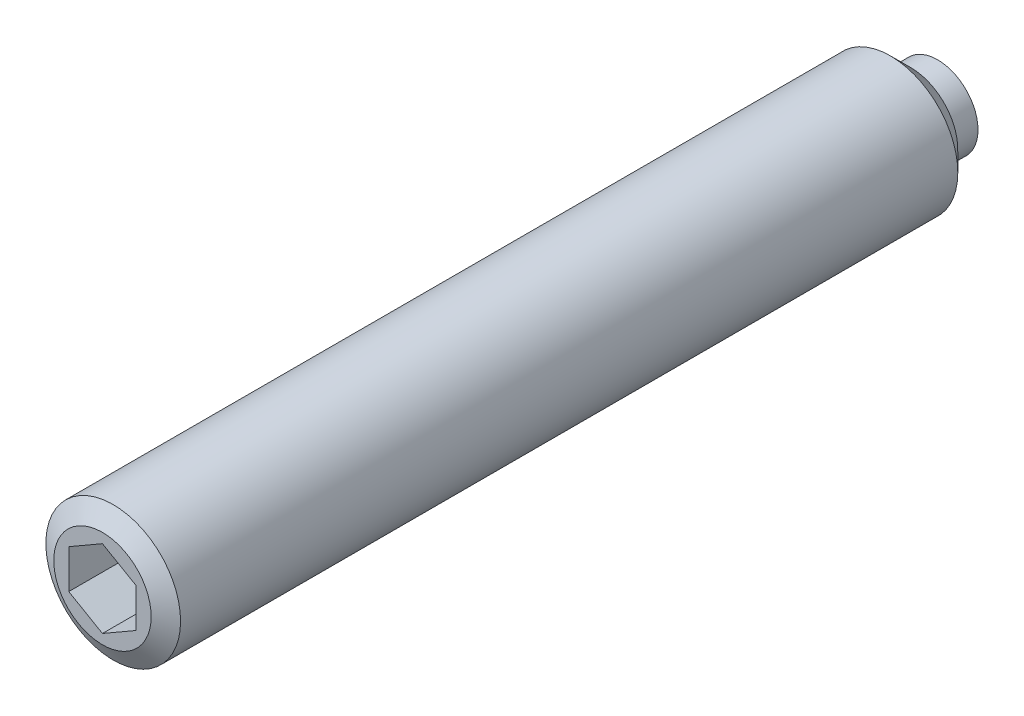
ISO-10303-21;
HEADER;
FILE_DESCRIPTION(('STEP AP214'),'2;1');
FILE_NAME('part.step','',(''),(''),'','','');
FILE_SCHEMA(('AUTOMOTIVE_DESIGN { 1 0 10303 214 1 1 1 1 }'));
ENDSEC;
DATA;
#1=APPLICATION_CONTEXT('core data for automotive mechanical design processes');
#2=APPLICATION_PROTOCOL_DEFINITION('international standard','automotive_design',2000,#1);
#3=PRODUCT_CONTEXT('',#1,'mechanical');
#4=PRODUCT('Part','Part','',(#3));
#5=PRODUCT_RELATED_PRODUCT_CATEGORY('part','',(#4));
#6=PRODUCT_DEFINITION_FORMATION('','',#4);
#7=PRODUCT_DEFINITION_CONTEXT('part definition',#1,'design');
#8=PRODUCT_DEFINITION('design','',#6,#7);
#9=PRODUCT_DEFINITION_SHAPE('','',#8);
#10=(LENGTH_UNIT() NAMED_UNIT(*) SI_UNIT(.MILLI.,.METRE.));
#11=(NAMED_UNIT(*) PLANE_ANGLE_UNIT() SI_UNIT($,.RADIAN.));
#12=(NAMED_UNIT(*) SI_UNIT($,.STERADIAN.) SOLID_ANGLE_UNIT());
#13=UNCERTAINTY_MEASURE_WITH_UNIT(LENGTH_MEASURE(1.E-05),#10,'distance_accuracy_value','');
#14=(GEOMETRIC_REPRESENTATION_CONTEXT(3) GLOBAL_UNCERTAINTY_ASSIGNED_CONTEXT((#13)) GLOBAL_UNIT_ASSIGNED_CONTEXT((#10,
#11,#12)) REPRESENTATION_CONTEXT('',''));
#15=CARTESIAN_POINT('',(0.,0.,0.));
#16=DIRECTION('',(0.,0.,1.));
#17=DIRECTION('',(1.,0.,0.));
#18=AXIS2_PLACEMENT_3D('',#15,#16,#17);
#19=CARTESIAN_POINT('',(3.,0.,0.));
#20=DIRECTION('',(0.,0.,-1.));
#21=DIRECTION('',(-1.,0.,0.));
#22=AXIS2_PLACEMENT_3D('',#19,#20,#21);
#23=PLANE('',#22);
#24=CARTESIAN_POINT('',(0.,0.,0.));
#25=DIRECTION('',(0.,0.,1.));
#26=DIRECTION('',(1.,0.,0.));
#27=AXIS2_PLACEMENT_3D('',#24,#25,#26);
#28=CIRCLE('',#27,3.);
#29=CARTESIAN_POINT('',(3.,0.,0.));
#30=VERTEX_POINT('',#29);
#31=EDGE_CURVE('E124',#30,#30,#28,.T.);
#32=ORIENTED_EDGE('',*,*,#31,.F.);
#33=EDGE_LOOP('',(#32));
#34=FACE_BOUND('',#33,.T.);
#35=ADVANCED_FACE('F14',(#34),#23,.T.);
#36=CARTESIAN_POINT('',(0.,0.,82.));
#37=DIRECTION('',(0.,0.,1.));
#38=DIRECTION('',(1.,0.,0.));
#39=AXIS2_PLACEMENT_3D('',#36,#37,#38);
#40=CYLINDRICAL_SURFACE('',#39,3.);
#41=CARTESIAN_POINT('',(0.,0.,2.));
#42=DIRECTION('',(0.,0.,1.));
#43=DIRECTION('',(1.,0.,0.));
#44=AXIS2_PLACEMENT_3D('',#41,#42,#43);
#45=CIRCLE('',#44,3.);
#46=CARTESIAN_POINT('',(3.,0.,2.));
#47=VERTEX_POINT('',#46);
#48=EDGE_CURVE('E121',#47,#47,#45,.T.);
#49=ORIENTED_EDGE('',*,*,#48,.F.);
#50=EDGE_LOOP('',(#49));
#51=FACE_BOUND('',#50,.T.);
#52=ORIENTED_EDGE('',*,*,#31,.T.);
#53=EDGE_LOOP('',(#52));
#54=FACE_BOUND('',#53,.T.);
#55=ADVANCED_FACE('F149',(#51,#54),#40,.T.);
#56=CARTESIAN_POINT('',(5.,0.,2.));
#57=DIRECTION('',(0.,0.,-1.));
#58=DIRECTION('',(-1.,0.,0.));
#59=AXIS2_PLACEMENT_3D('',#56,#57,#58);
#60=PLANE('',#59);
#61=CARTESIAN_POINT('',(0.,0.,2.));
#62=DIRECTION('',(0.,0.,-1.));
#63=DIRECTION('',(-1.,0.,0.));
#64=AXIS2_PLACEMENT_3D('',#61,#62,#63);
#65=CIRCLE('',#64,3.5);
#66=CARTESIAN_POINT('',(-3.5,0.,2.));
#67=VERTEX_POINT('',#66);
#68=EDGE_CURVE('E130',#67,#67,#65,.T.);
#69=ORIENTED_EDGE('',*,*,#68,.T.);
#70=EDGE_LOOP('',(#69));
#71=FACE_BOUND('',#70,.T.);
#72=ORIENTED_EDGE('',*,*,#48,.T.);
#73=EDGE_LOOP('',(#72));
#74=FACE_BOUND('',#73,.T.);
#75=ADVANCED_FACE('F155',(#71,#74),#60,.T.);
#76=CARTESIAN_POINT('',(0.,0.,82.));
#77=DIRECTION('',(0.,0.,1.));
#78=DIRECTION('',(1.,0.,0.));
#79=AXIS2_PLACEMENT_3D('',#76,#77,#78);
#80=CYLINDRICAL_SURFACE('',#79,5.);
#81=CARTESIAN_POINT('',(0.,0.,61.2));
#82=DIRECTION('',(0.,0.,1.));
#83=DIRECTION('',(1.,0.,0.));
#84=AXIS2_PLACEMENT_3D('',#81,#82,#83);
#85=CIRCLE('',#84,5.);
#86=CARTESIAN_POINT('',(5.,0.,61.2));
#87=VERTEX_POINT('',#86);
#88=EDGE_CURVE('E9',#87,#87,#85,.F.);
#89=ORIENTED_EDGE('',*,*,#88,.T.);
#90=EDGE_LOOP('',(#89));
#91=FACE_BOUND('',#90,.T.);
#92=CARTESIAN_POINT('',(0.,0.,3.5));
#93=DIRECTION('',(0.,0.,-1.));
#94=DIRECTION('',(-1.,0.,0.));
#95=AXIS2_PLACEMENT_3D('',#92,#93,#94);
#96=CIRCLE('',#95,5.);
#97=CARTESIAN_POINT('',(-5.,0.,3.5));
#98=VERTEX_POINT('',#97);
#99=EDGE_CURVE('E127',#98,#98,#96,.F.);
#100=ORIENTED_EDGE('',*,*,#99,.T.);
#101=EDGE_LOOP('',(#100));
#102=FACE_BOUND('',#101,.T.);
#103=ADVANCED_FACE('F162',(#91,#102),#80,.T.);
#104=CARTESIAN_POINT('',(0.,0.,62.));
#105=DIRECTION('',(0.,0.,1.));
#106=DIRECTION('',(1.,0.,0.));
#107=AXIS2_PLACEMENT_3D('',#104,#105,#106);
#108=PLANE('',#107);
#109=CARTESIAN_POINT('',(0.,0.,62.));
#110=DIRECTION('',(0.,0.,1.));
#111=DIRECTION('',(1.,0.,0.));
#112=AXIS2_PLACEMENT_3D('',#109,#110,#111);
#113=CIRCLE('',#112,3.6143593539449);
#114=CARTESIAN_POINT('',(3.6143593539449,0.,62.));
#115=VERTEX_POINT('',#114);
#116=EDGE_CURVE('E22',#115,#115,#113,.T.);
#117=ORIENTED_EDGE('',*,*,#116,.T.);
#118=EDGE_LOOP('',(#117));
#119=FACE_BOUND('',#118,.T.);
#120=DIRECTION('',(0.86602540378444,-0.5,0.));
#121=VECTOR('',#120,1.);
#122=CARTESIAN_POINT('',(-2.5,-1.44337567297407,62.));
#123=LINE('',#122,#121);
#124=CARTESIAN_POINT('',(-2.5,-1.44337567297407,62.));
#125=VERTEX_POINT('',#124);
#126=CARTESIAN_POINT('',(0.,-2.88675134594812,62.));
#127=VERTEX_POINT('',#126);
#128=EDGE_CURVE('E29',#125,#127,#123,.T.);
#129=ORIENTED_EDGE('',*,*,#128,.F.);
#130=DIRECTION('',(0.,-1.,0.));
#131=VECTOR('',#130,1.);
#132=CARTESIAN_POINT('',(-2.5,1.44337567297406,62.));
#133=LINE('',#132,#131);
#134=CARTESIAN_POINT('',(-2.5,1.44337567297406,62.));
#135=VERTEX_POINT('',#134);
#136=EDGE_CURVE('E97',#135,#125,#133,.T.);
#137=ORIENTED_EDGE('',*,*,#136,.F.);
#138=DIRECTION('',(0.866025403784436,0.5,0.));
#139=VECTOR('',#138,1.);
#140=CARTESIAN_POINT('',(-2.5,1.44337567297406,62.));
#141=LINE('',#140,#139);
#142=CARTESIAN_POINT('',(0.,2.88675134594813,62.));
#143=VERTEX_POINT('',#142);
#144=EDGE_CURVE('E92',#135,#143,#141,.T.);
#145=ORIENTED_EDGE('',*,*,#144,.T.);
#146=DIRECTION('',(-0.866025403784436,0.5,0.));
#147=VECTOR('',#146,1.);
#148=CARTESIAN_POINT('',(2.5,1.44337567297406,62.));
#149=LINE('',#148,#147);
#150=CARTESIAN_POINT('',(2.5,1.44337567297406,62.));
#151=VERTEX_POINT('',#150);
#152=EDGE_CURVE('E90',#151,#143,#149,.T.);
#153=ORIENTED_EDGE('',*,*,#152,.F.);
#154=DIRECTION('',(0.,-1.,0.));
#155=VECTOR('',#154,1.);
#156=CARTESIAN_POINT('',(2.5,1.44337567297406,62.));
#157=LINE('',#156,#155);
#158=CARTESIAN_POINT('',(2.5,-1.44337567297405,62.));
#159=VERTEX_POINT('',#158);
#160=EDGE_CURVE('E72',#151,#159,#157,.T.);
#161=ORIENTED_EDGE('',*,*,#160,.T.);
#162=DIRECTION('',(-0.866025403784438,-0.5,0.));
#163=VECTOR('',#162,1.);
#164=CARTESIAN_POINT('',(2.5,-1.44337567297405,62.));
#165=LINE('',#164,#163);
#166=EDGE_CURVE('E83',#159,#127,#165,.T.);
#167=ORIENTED_EDGE('',*,*,#166,.T.);
#168=EDGE_LOOP('',(#129,#137,#145,#153,#161,#167));
#169=FACE_BOUND('',#168,.T.);
#170=ADVANCED_FACE('F87',(#119,#169),#108,.T.);
#171=CARTESIAN_POINT('',(-2.5,-1.44337567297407,58.));
#172=DIRECTION('',(-0.5,-0.86602540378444,0.));
#173=DIRECTION('',(-0.86602540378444,0.5,0.));
#174=AXIS2_PLACEMENT_3D('',#171,#172,#173);
#175=PLANE('',#174);
#176=DIRECTION('',(0.,0.,1.));
#177=VECTOR('',#176,1.);
#178=CARTESIAN_POINT('',(-2.5,-1.44337567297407,58.));
#179=LINE('',#178,#177);
#180=CARTESIAN_POINT('',(-2.5,-1.44337567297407,58.));
#181=VERTEX_POINT('',#180);
#182=EDGE_CURVE('E36',#181,#125,#179,.T.);
#183=ORIENTED_EDGE('',*,*,#182,.T.);
#184=ORIENTED_EDGE('',*,*,#128,.T.);
#185=DIRECTION('',(0.,0.,1.));
#186=VECTOR('',#185,1.);
#187=CARTESIAN_POINT('',(0.,-2.88675134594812,58.));
#188=LINE('',#187,#186);
#189=CARTESIAN_POINT('',(0.,-2.88675134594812,58.));
#190=VERTEX_POINT('',#189);
#191=EDGE_CURVE('E80',#190,#127,#188,.T.);
#192=ORIENTED_EDGE('',*,*,#191,.F.);
#193=DIRECTION('',(0.86602540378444,-0.5,0.));
#194=VECTOR('',#193,1.);
#195=CARTESIAN_POINT('',(-2.5,-1.44337567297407,58.));
#196=LINE('',#195,#194);
#197=EDGE_CURVE('E99',#181,#190,#196,.T.);
#198=ORIENTED_EDGE('',*,*,#197,.F.);
#199=EDGE_LOOP('',(#183,#184,#192,#198));
#200=FACE_BOUND('',#199,.T.);
#201=ADVANCED_FACE('F169',(#200),#175,.F.);
#202=CARTESIAN_POINT('',(-2.5,1.44337567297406,58.));
#203=DIRECTION('',(-1.,0.,0.));
#204=DIRECTION('',(0.,1.,0.));
#205=AXIS2_PLACEMENT_3D('',#202,#203,#204);
#206=PLANE('',#205);
#207=DIRECTION('',(0.,0.,1.));
#208=VECTOR('',#207,1.);
#209=CARTESIAN_POINT('',(-2.5,1.44337567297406,58.));
#210=LINE('',#209,#208);
#211=CARTESIAN_POINT('',(-2.5,1.44337567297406,58.));
#212=VERTEX_POINT('',#211);
#213=EDGE_CURVE('E118',#212,#135,#210,.T.);
#214=ORIENTED_EDGE('',*,*,#213,.T.);
#215=ORIENTED_EDGE('',*,*,#136,.T.);
#216=ORIENTED_EDGE('',*,*,#182,.F.);
#217=DIRECTION('',(0.,-1.,0.));
#218=VECTOR('',#217,1.);
#219=CARTESIAN_POINT('',(-2.5,1.44337567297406,58.));
#220=LINE('',#219,#218);
#221=EDGE_CURVE('E111',#212,#181,#220,.T.);
#222=ORIENTED_EDGE('',*,*,#221,.F.);
#223=EDGE_LOOP('',(#214,#215,#216,#222));
#224=FACE_BOUND('',#223,.T.);
#225=ADVANCED_FACE('F170',(#224),#206,.F.);
#226=CARTESIAN_POINT('',(-2.5,1.44337567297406,58.));
#227=DIRECTION('',(0.5,-0.866025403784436,0.));
#228=DIRECTION('',(-0.866025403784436,-0.5,0.));
#229=AXIS2_PLACEMENT_3D('',#226,#227,#228);
#230=PLANE('',#229);
#231=DIRECTION('',(0.,0.,1.));
#232=VECTOR('',#231,1.);
#233=CARTESIAN_POINT('',(0.,2.88675134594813,58.));
#234=LINE('',#233,#232);
#235=CARTESIAN_POINT('',(0.,2.88675134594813,58.));
#236=VERTEX_POINT('',#235);
#237=EDGE_CURVE('E116',#236,#143,#234,.T.);
#238=ORIENTED_EDGE('',*,*,#237,.T.);
#239=ORIENTED_EDGE('',*,*,#144,.F.);
#240=ORIENTED_EDGE('',*,*,#213,.F.);
#241=DIRECTION('',(0.866025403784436,0.5,0.));
#242=VECTOR('',#241,1.);
#243=CARTESIAN_POINT('',(-2.5,1.44337567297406,58.));
#244=LINE('',#243,#242);
#245=EDGE_CURVE('E108',#212,#236,#244,.T.);
#246=ORIENTED_EDGE('',*,*,#245,.T.);
#247=EDGE_LOOP('',(#238,#239,#240,#246));
#248=FACE_BOUND('',#247,.T.);
#249=ADVANCED_FACE('F173',(#248),#230,.T.);
#250=CARTESIAN_POINT('',(2.5,1.44337567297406,58.));
#251=DIRECTION('',(0.5,0.866025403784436,0.));
#252=DIRECTION('',(0.866025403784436,-0.5,0.));
#253=AXIS2_PLACEMENT_3D('',#250,#251,#252);
#254=PLANE('',#253);
#255=DIRECTION('',(0.,0.,1.));
#256=VECTOR('',#255,1.);
#257=CARTESIAN_POINT('',(2.5,1.44337567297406,58.));
#258=LINE('',#257,#256);
#259=CARTESIAN_POINT('',(2.5,1.44337567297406,58.));
#260=VERTEX_POINT('',#259);
#261=EDGE_CURVE('E79',#260,#151,#258,.T.);
#262=ORIENTED_EDGE('',*,*,#261,.T.);
#263=ORIENTED_EDGE('',*,*,#152,.T.);
#264=ORIENTED_EDGE('',*,*,#237,.F.);
#265=DIRECTION('',(-0.866025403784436,0.5,0.));
#266=VECTOR('',#265,1.);
#267=CARTESIAN_POINT('',(2.5,1.44337567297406,58.));
#268=LINE('',#267,#266);
#269=EDGE_CURVE('E105',#260,#236,#268,.T.);
#270=ORIENTED_EDGE('',*,*,#269,.F.);
#271=EDGE_LOOP('',(#262,#263,#264,#270));
#272=FACE_BOUND('',#271,.T.);
#273=ADVANCED_FACE('F176',(#272),#254,.F.);
#274=CARTESIAN_POINT('',(2.5,1.44337567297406,58.));
#275=DIRECTION('',(-1.,0.,0.));
#276=DIRECTION('',(0.,1.,0.));
#277=AXIS2_PLACEMENT_3D('',#274,#275,#276);
#278=PLANE('',#277);
#279=DIRECTION('',(0.,0.,1.));
#280=VECTOR('',#279,1.);
#281=CARTESIAN_POINT('',(2.5,-1.44337567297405,58.));
#282=LINE('',#281,#280);
#283=CARTESIAN_POINT('',(2.5,-1.44337567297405,58.));
#284=VERTEX_POINT('',#283);
#285=EDGE_CURVE('E68',#284,#159,#282,.T.);
#286=ORIENTED_EDGE('',*,*,#285,.T.);
#287=ORIENTED_EDGE('',*,*,#160,.F.);
#288=ORIENTED_EDGE('',*,*,#261,.F.);
#289=DIRECTION('',(0.,-1.,0.));
#290=VECTOR('',#289,1.);
#291=CARTESIAN_POINT('',(2.5,1.44337567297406,58.));
#292=LINE('',#291,#290);
#293=EDGE_CURVE('E75',#260,#284,#292,.T.);
#294=ORIENTED_EDGE('',*,*,#293,.T.);
#295=EDGE_LOOP('',(#286,#287,#288,#294));
#296=FACE_BOUND('',#295,.T.);
#297=ADVANCED_FACE('F70',(#296),#278,.T.);
#298=CARTESIAN_POINT('',(2.5,-1.44337567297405,58.));
#299=DIRECTION('',(-0.5,0.866025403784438,0.));
#300=DIRECTION('',(0.866025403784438,0.5,0.));
#301=AXIS2_PLACEMENT_3D('',#298,#299,#300);
#302=PLANE('',#301);
#303=DIRECTION('',(-0.866025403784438,-0.5,0.));
#304=VECTOR('',#303,1.);
#305=CARTESIAN_POINT('',(2.5,-1.44337567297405,58.));
#306=LINE('',#305,#304);
#307=EDGE_CURVE('E102',#284,#190,#306,.T.);
#308=ORIENTED_EDGE('',*,*,#307,.T.);
#309=ORIENTED_EDGE('',*,*,#191,.T.);
#310=ORIENTED_EDGE('',*,*,#166,.F.);
#311=ORIENTED_EDGE('',*,*,#285,.F.);
#312=EDGE_LOOP('',(#308,#309,#310,#311));
#313=FACE_BOUND('',#312,.T.);
#314=ADVANCED_FACE('F84',(#313),#302,.T.);
#315=CARTESIAN_POINT('',(2.5,-4.33012701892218,58.));
#316=DIRECTION('',(0.,0.,-1.));
#317=DIRECTION('',(-1.,0.,0.));
#318=AXIS2_PLACEMENT_3D('',#315,#316,#317);
#319=PLANE('',#318);
#320=ORIENTED_EDGE('',*,*,#197,.T.);
#321=ORIENTED_EDGE('',*,*,#307,.F.);
#322=ORIENTED_EDGE('',*,*,#293,.F.);
#323=ORIENTED_EDGE('',*,*,#269,.T.);
#324=ORIENTED_EDGE('',*,*,#245,.F.);
#325=ORIENTED_EDGE('',*,*,#221,.T.);
#326=EDGE_LOOP('',(#320,#321,#322,#323,#324,#325));
#327=FACE_BOUND('',#326,.T.);
#328=ADVANCED_FACE('F144',(#327),#319,.F.);
#329=CARTESIAN_POINT('',(0.,0.,3.5));
#330=DIRECTION('',(0.,0.,1.));
#331=DIRECTION('',(1.,0.,0.));
#332=AXIS2_PLACEMENT_3D('',#329,#330,#331);
#333=CONICAL_SURFACE('',#332,5.,0.785398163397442);
#334=ORIENTED_EDGE('',*,*,#68,.F.);
#335=EDGE_LOOP('',(#334));
#336=FACE_BOUND('',#335,.T.);
#337=ORIENTED_EDGE('',*,*,#99,.F.);
#338=EDGE_LOOP('',(#337));
#339=FACE_BOUND('',#338,.T.);
#340=ADVANCED_FACE('F137',(#336,#339),#333,.T.);
#341=CARTESIAN_POINT('',(0.,0.,62.));
#342=DIRECTION('',(0.,0.,-1.));
#343=DIRECTION('',(-1.,0.,0.));
#344=AXIS2_PLACEMENT_3D('',#341,#342,#343);
#345=CONICAL_SURFACE('',#344,3.6143593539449,1.0471975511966);
#346=ORIENTED_EDGE('',*,*,#88,.F.);
#347=EDGE_LOOP('',(#346));
#348=FACE_BOUND('',#347,.T.);
#349=ORIENTED_EDGE('',*,*,#116,.F.);
#350=EDGE_LOOP('',(#349));
#351=FACE_BOUND('',#350,.T.);
#352=ADVANCED_FACE('F16',(#348,#351),#345,.T.);
#353=CLOSED_SHELL('',(#35,#55,#75,#103,#170,#201,#225,#249,#273,#297,#314,#328,#340,#352));
#354=MANIFOLD_SOLID_BREP('B1',#353);
#355=ADVANCED_BREP_SHAPE_REPRESENTATION('',(#18,#354),#14);
#356=SHAPE_DEFINITION_REPRESENTATION(#9,#355);
ENDSEC;
END-ISO-10303-21;
